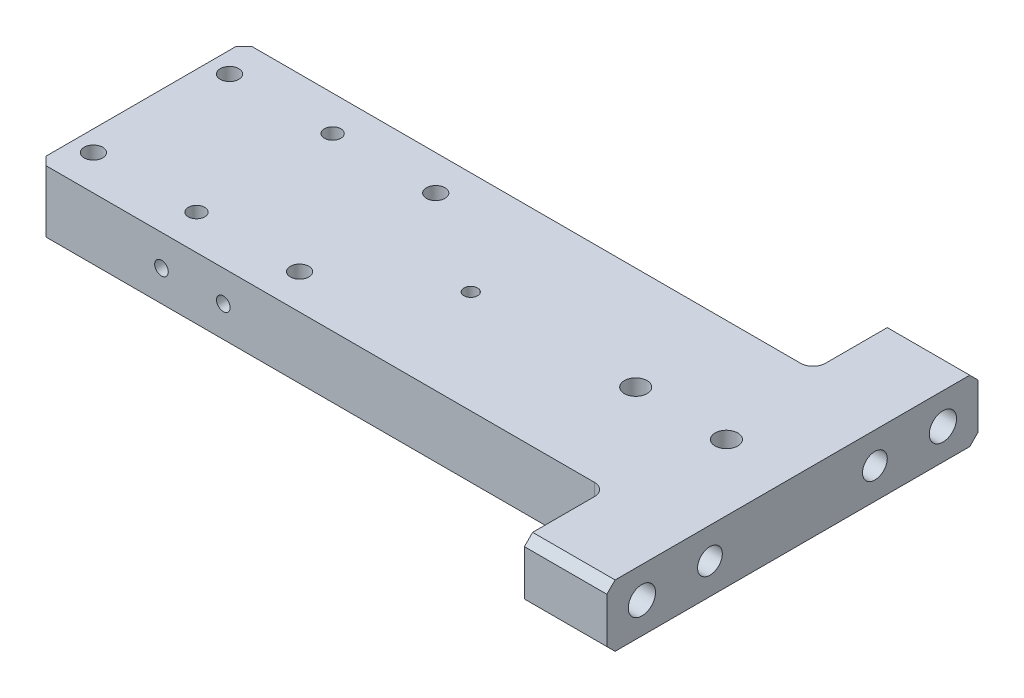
from build123d import *

# Parameters (mm, degrees)
SKETCH_1_W                   = 158
SKETCH_1_H                   = 90
EXTRUDE_1_DEPTH              = 15
HOLE_WIZARD_M4_1_D           = 4.5
HOLE_WIZARD_M4_1_CBORE_D     = 8
HOLE_WIZARD_M4_1_CBORE_DEPTH = 4.6
F_4_0MM_1_D                  = 4
F_4_0MM_1_DEPTH              = 5
HOLE_WIZARD_M4_3_D           = 3.3
SKETCH_49_W                  = 203.979037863
SKETCH_49_H                  = 40.618412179
SKETCH_49_H_2                = 63.761491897
CUT_EXTRUDE_3_DEPTH          = 93.146622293
HOLE_WIZARD_M6_2_D           = 6.6
F_6_0MM_1_D                  = 6
F_6_0MM_1_DEPTH              = 5
HOLE_WIZARD_M4_4_D           = 3.3
HOLE_WIZARD_M4_4_DEPTH       = 8
HOLE_WIZARD_M4_4_TIP         = 0.991420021
HOLE_WIZARD_M4_5_D           = 3.3
HOLE_WIZARD_M4_5_DEPTH       = 10.1
HOLE_WIZARD_M4_5_TIP         = 0.991420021
FILLET_2_R                   = 3
CHAMFER_4_SIZE               = 2
HOLE_WIZARD_M5_1_D           = 5.5
HOLE_WIZARD_M5_1_CBORE_D     = 10
HOLE_WIZARD_M5_1_CBORE_DEPTH = 5.4
HOLE_WIZARD_M4_6_AT_2_COUNT  = 2
HOLE_WIZARD_M4_6_AT_2_PITCH  = 15


with BuildPart() as part:
    # Sketch 1 → Extrude 1 (new body)
    with BuildSketch(Plane(origin=(0, 0, 0), x_dir=(1, 0, 0), z_dir=(0, 1, 0))):
        Rectangle(SKETCH_1_W, SKETCH_1_H)
    extrude(amount=EXTRUDE_1_DEPTH)

    # Hole Wizard M4 _1 (through all)
    with Locations(Plane(origin=(0, 0, 0), x_dir=(-1, 0, 0), z_dir=(0, -1, 0))):
        with Locations((74, 16.5), (74, -16.5), (24, 16.5), (24, -16.5)):
            CounterBoreHole(HOLE_WIZARD_M4_1_D / 2, HOLE_WIZARD_M4_1_CBORE_D / 2, HOLE_WIZARD_M4_1_CBORE_DEPTH)

    # 4.0mm _1
    with Locations(Plane(origin=(0, 15, 0), x_dir=(1, 0, 0), z_dir=(0, 1, 0))):
        with Locations((-49, -16.5), (-49, 16.5)):
            Hole(F_4_0MM_1_D / 2, depth=F_4_0MM_1_DEPTH)

    # Hole Wizard M4 _3 (through all)
    with Locations(Plane(origin=(0, 15, 0), x_dir=(1, 0, 0), z_dir=(0, 1, 0))):
        with Locations((1, 0)):
            Hole(HOLE_WIZARD_M4_3_D / 2)

    # Sketch 49 → Cut-Extrude 3 (cut, through all)
    with BuildSketch(Plane(origin=(0, 15, 0), x_dir=(1, 0, 0), z_dir=(0, 1, 0))):
        with Locations((-42.989518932, -45.30920609)):
            Rectangle(SKETCH_49_W, SKETCH_49_H)
        with Locations((-42.989518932, 56.880745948)):
            Rectangle(SKETCH_49_W, SKETCH_49_H_2)
    extrude(amount=-CUT_EXTRUDE_3_DEPTH, mode=Mode.SUBTRACT)

    # Hole Wizard M6 _2 (through all)
    with Locations(Plane.ZY.offset(-59)):
        with Locations((36.5, 7.5), (-36.5, 7.5)):
            Hole(HOLE_WIZARD_M6_2_D / 2)

    # 6.0mm _1
    with Locations(Plane(origin=(79, 0, 0), x_dir=(0, 0, -1), z_dir=(1, 0, 0))):
        with Locations((-20, 7.5), (20, 7.5)):
            Hole(F_6_0MM_1_D / 2, depth=F_6_0MM_1_DEPTH)

    # Hole Wizard M4 _4
    with Locations(Plane(origin=(0, 0, 0), x_dir=(-1, 0, 0), z_dir=(0, -1, 0))):
        with Locations((30, 6), (45, 6)):
            Hole(HOLE_WIZARD_M4_4_D / 2, depth=HOLE_WIZARD_M4_4_DEPTH)
            with Locations((0, 0, -(HOLE_WIZARD_M4_4_DEPTH + HOLE_WIZARD_M4_4_TIP / 2))):  # 118° drill point
                Cone(0, HOLE_WIZARD_M4_4_D / 2, HOLE_WIZARD_M4_4_TIP, mode=Mode.SUBTRACT)

    # Hole Wizard M4 _5
    with Locations(Plane(origin=(0, 0, -25), x_dir=(-1, 0, 0), z_dir=(0, 0, -1))):
        with Locations((4, 7.5)):
            Hole(HOLE_WIZARD_M4_5_D / 2, depth=HOLE_WIZARD_M4_5_DEPTH)
            with Locations((0, 0, -(HOLE_WIZARD_M4_5_DEPTH + HOLE_WIZARD_M4_5_TIP / 2))):  # 118° drill point
                Cone(0, HOLE_WIZARD_M4_5_D / 2, HOLE_WIZARD_M4_5_TIP, mode=Mode.SUBTRACT)

    # Fillet 2
    fillet_2_edges = [part.edges().sort_by_distance(p)[0] for p in [
        (59, 7.5, 25),
        (59, 7.5, -25),
    ]]
    fillet(fillet_2_edges, radius=FILLET_2_R)

    # Chamfer 4
    chamfer_4_edges = [part.edges().sort_by_distance(p)[0] for p in [
        (69, 0, -45),
        (69, 0, 45),
        (69, 15, 45),
        (-79, 7.5, 25),
        (69, 15, -45),
        (-79, 7.5, -25),
    ]]
    chamfer(chamfer_4_edges, length=CHAMFER_4_SIZE)

    # Hole Wizard M5 _1 (through all)
    with Locations(Plane(origin=(0, 0, 0), x_dir=(-1, 0, 0), z_dir=(0, -1, 0))):
        with Locations((-63, 0), (-41, 0)):
            CounterBoreHole(HOLE_WIZARD_M5_1_D / 2, HOLE_WIZARD_M5_1_CBORE_D / 2, HOLE_WIZARD_M5_1_CBORE_DEPTH)

    # Sketch 70 → Hole Wizard M4 _6 (revolve, cut)
    with BuildSketch(Plane(origin=(-49, 7.5, 25), x_dir=(0, -1, 0), z_dir=(1, 0, 0))):
        Polygon((0, 0), (0, 11.091420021), (1.65, 10.1), (1.65, 0), align=None)
    hole_wizard_m4_6 = revolve(axis=Axis((-49, 7.5, 31.35), (0, 0, -1)), mode=Mode.SUBTRACT)

    # Hole Wizard M4 _6 at 2: Hole Wizard M4 _6 ×2
    with Locations(*[(i * HOLE_WIZARD_M4_6_AT_2_PITCH, 0, 0) for i in range(1, HOLE_WIZARD_M4_6_AT_2_COUNT)]):
        add(hole_wizard_m4_6, mode=Mode.SUBTRACT)

    # Mirror 1: Hole Wizard M4 _6 across plane
    add(hole_wizard_m4_6.mirror(Plane.XY), mode=Mode.SUBTRACT)

    # Mirror 1 copy 1 sketch → Mirror 1 copy 1 (revolve, cut)
    with BuildSketch(Plane(origin=(-34, 7.5, -25), x_dir=(0, -1, 0), z_dir=(1, 0, 0))):
        Polygon((0, 0), (0, -11.091420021), (1.65, -10.1), (1.65, 0), align=None)
    revolve(axis=Axis((-34, 7.5, -31.35), (0, 0, -1)), mode=Mode.SUBTRACT)


solid = part.part
